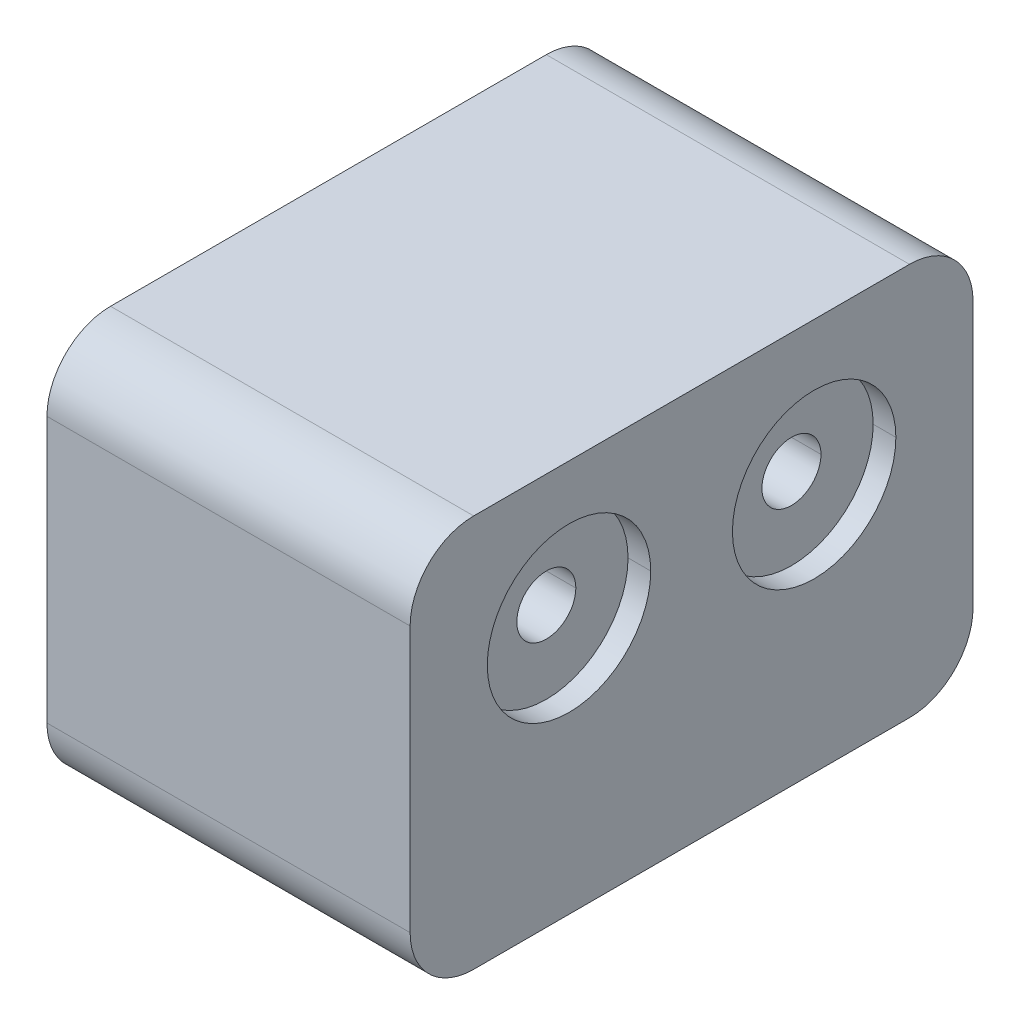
ISO-10303-21;
HEADER;
FILE_DESCRIPTION(('STEP AP214'),'2;1');
FILE_NAME('part.step','',(''),(''),'','','');
FILE_SCHEMA(('AUTOMOTIVE_DESIGN { 1 0 10303 214 1 1 1 1 }'));
ENDSEC;
DATA;
#1=APPLICATION_CONTEXT('core data for automotive mechanical design processes');
#2=APPLICATION_PROTOCOL_DEFINITION('international standard','automotive_design',2000,#1);
#3=PRODUCT_CONTEXT('',#1,'mechanical');
#4=PRODUCT('Part','Part','',(#3));
#5=PRODUCT_RELATED_PRODUCT_CATEGORY('part','',(#4));
#6=PRODUCT_DEFINITION_FORMATION('','',#4);
#7=PRODUCT_DEFINITION_CONTEXT('part definition',#1,'design');
#8=PRODUCT_DEFINITION('design','',#6,#7);
#9=PRODUCT_DEFINITION_SHAPE('','',#8);
#10=(LENGTH_UNIT() NAMED_UNIT(*) SI_UNIT(.MILLI.,.METRE.));
#11=(NAMED_UNIT(*) PLANE_ANGLE_UNIT() SI_UNIT($,.RADIAN.));
#12=(NAMED_UNIT(*) SI_UNIT($,.STERADIAN.) SOLID_ANGLE_UNIT());
#13=UNCERTAINTY_MEASURE_WITH_UNIT(LENGTH_MEASURE(1.E-05),#10,'distance_accuracy_value','');
#14=(GEOMETRIC_REPRESENTATION_CONTEXT(3) GLOBAL_UNCERTAINTY_ASSIGNED_CONTEXT((#13)) GLOBAL_UNIT_ASSIGNED_CONTEXT((#10,
#11,#12)) REPRESENTATION_CONTEXT('',''));
#15=CARTESIAN_POINT('',(0.,0.,0.));
#16=DIRECTION('',(0.,0.,1.));
#17=DIRECTION('',(1.,0.,0.));
#18=AXIS2_PLACEMENT_3D('',#15,#16,#17);
#19=CARTESIAN_POINT('',(8.,2.6,6.2));
#20=DIRECTION('',(0.,0.,-1.));
#21=DIRECTION('',(-1.,0.,0.));
#22=AXIS2_PLACEMENT_3D('',#19,#20,#21);
#23=PLANE('',#22);
#24=DIRECTION('',(0.,-1.,0.));
#25=VECTOR('',#24,1.);
#26=CARTESIAN_POINT('',(0.,2.6,6.2));
#27=LINE('',#26,#25);
#28=CARTESIAN_POINT('',(0.,2.6,6.2));
#29=VERTEX_POINT('',#28);
#30=CARTESIAN_POINT('',(0.,-3.25,6.2));
#31=VERTEX_POINT('',#30);
#32=EDGE_CURVE('E11',#29,#31,#27,.T.);
#33=ORIENTED_EDGE('',*,*,#32,.T.);
#34=DIRECTION('',(-1.,0.,0.));
#35=VECTOR('',#34,1.);
#36=CARTESIAN_POINT('',(8.,-3.25,6.2));
#37=LINE('',#36,#35);
#38=CARTESIAN_POINT('',(8.,-3.25,6.2));
#39=VERTEX_POINT('',#38);
#40=EDGE_CURVE('E25',#39,#31,#37,.T.);
#41=ORIENTED_EDGE('',*,*,#40,.F.);
#42=DIRECTION('',(0.,-1.,0.));
#43=VECTOR('',#42,1.);
#44=CARTESIAN_POINT('',(8.,2.6,6.2));
#45=LINE('',#44,#43);
#46=CARTESIAN_POINT('',(8.,2.6,6.2));
#47=VERTEX_POINT('',#46);
#48=EDGE_CURVE('E425',#47,#39,#45,.T.);
#49=ORIENTED_EDGE('',*,*,#48,.F.);
#50=DIRECTION('',(-1.,0.,0.));
#51=VECTOR('',#50,1.);
#52=CARTESIAN_POINT('',(8.,2.6,6.2));
#53=LINE('',#52,#51);
#54=EDGE_CURVE('E421',#47,#29,#53,.T.);
#55=ORIENTED_EDGE('',*,*,#54,.T.);
#56=EDGE_LOOP('',(#33,#41,#49,#55));
#57=FACE_BOUND('',#56,.T.);
#58=ADVANCED_FACE('F17',(#57),#23,.F.);
#59=CARTESIAN_POINT('',(8.,2.60000000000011,4.80000000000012));
#60=DIRECTION('',(-1.,0.,0.));
#61=DIRECTION('',(0.,-0.707106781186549,-0.707106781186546));
#62=AXIS2_PLACEMENT_3D('',#59,#60,#61);
#63=CYLINDRICAL_SURFACE('',#62,1.39999999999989);
#64=CARTESIAN_POINT('',(0.,2.60000000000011,4.80000000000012));
#65=DIRECTION('',(1.,0.,0.));
#66=DIRECTION('',(0.,0.,-1.));
#67=AXIS2_PLACEMENT_3D('',#64,#65,#66);
#68=CIRCLE('',#67,1.39999999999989);
#69=CARTESIAN_POINT('',(0.,4.,4.8));
#70=VERTEX_POINT('',#69);
#71=EDGE_CURVE('E416',#70,#29,#68,.T.);
#72=ORIENTED_EDGE('',*,*,#71,.T.);
#73=ORIENTED_EDGE('',*,*,#54,.F.);
#74=CARTESIAN_POINT('',(8.,2.60000000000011,4.80000000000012));
#75=DIRECTION('',(1.,0.,0.));
#76=DIRECTION('',(0.,0.,-1.));
#77=AXIS2_PLACEMENT_3D('',#74,#75,#76);
#78=CIRCLE('',#77,1.39999999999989);
#79=CARTESIAN_POINT('',(8.,4.,4.8));
#80=VERTEX_POINT('',#79);
#81=EDGE_CURVE('E411',#80,#47,#78,.T.);
#82=ORIENTED_EDGE('',*,*,#81,.F.);
#83=DIRECTION('',(-1.,0.,0.));
#84=VECTOR('',#83,1.);
#85=CARTESIAN_POINT('',(8.,4.,4.8));
#86=LINE('',#85,#84);
#87=EDGE_CURVE('E407',#80,#70,#86,.T.);
#88=ORIENTED_EDGE('',*,*,#87,.T.);
#89=EDGE_LOOP('',(#72,#73,#82,#88));
#90=FACE_BOUND('',#89,.T.);
#91=ADVANCED_FACE('F443',(#90),#63,.T.);
#92=CARTESIAN_POINT('',(8.,4.,-4.8));
#93=DIRECTION('',(0.,-1.,0.));
#94=DIRECTION('',(0.,0.,-1.));
#95=AXIS2_PLACEMENT_3D('',#92,#93,#94);
#96=PLANE('',#95);
#97=DIRECTION('',(0.,0.,1.));
#98=VECTOR('',#97,1.);
#99=CARTESIAN_POINT('',(0.,4.,-4.8));
#100=LINE('',#99,#98);
#101=CARTESIAN_POINT('',(0.,4.,-4.8));
#102=VERTEX_POINT('',#101);
#103=EDGE_CURVE('E402',#102,#70,#100,.T.);
#104=ORIENTED_EDGE('',*,*,#103,.T.);
#105=ORIENTED_EDGE('',*,*,#87,.F.);
#106=DIRECTION('',(0.,0.,1.));
#107=VECTOR('',#106,1.);
#108=CARTESIAN_POINT('',(8.,4.,-4.8));
#109=LINE('',#108,#107);
#110=CARTESIAN_POINT('',(8.,4.,-4.8));
#111=VERTEX_POINT('',#110);
#112=EDGE_CURVE('E397',#111,#80,#109,.T.);
#113=ORIENTED_EDGE('',*,*,#112,.F.);
#114=DIRECTION('',(-1.,0.,0.));
#115=VECTOR('',#114,1.);
#116=CARTESIAN_POINT('',(8.,4.,-4.8));
#117=LINE('',#116,#115);
#118=EDGE_CURVE('E393',#111,#102,#117,.T.);
#119=ORIENTED_EDGE('',*,*,#118,.T.);
#120=EDGE_LOOP('',(#104,#105,#113,#119));
#121=FACE_BOUND('',#120,.T.);
#122=ADVANCED_FACE('F464',(#121),#96,.F.);
#123=CARTESIAN_POINT('',(8.,2.60000000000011,-4.80000000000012));
#124=DIRECTION('',(-1.,0.,0.));
#125=DIRECTION('',(0.,-0.707106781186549,0.707106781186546));
#126=AXIS2_PLACEMENT_3D('',#123,#124,#125);
#127=CYLINDRICAL_SURFACE('',#126,1.39999999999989);
#128=CARTESIAN_POINT('',(0.,2.60000000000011,-4.80000000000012));
#129=DIRECTION('',(1.,0.,0.));
#130=DIRECTION('',(0.,0.,-1.));
#131=AXIS2_PLACEMENT_3D('',#128,#129,#130);
#132=CIRCLE('',#131,1.39999999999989);
#133=CARTESIAN_POINT('',(0.,2.6,-6.2));
#134=VERTEX_POINT('',#133);
#135=EDGE_CURVE('E388',#134,#102,#132,.T.);
#136=ORIENTED_EDGE('',*,*,#135,.T.);
#137=ORIENTED_EDGE('',*,*,#118,.F.);
#138=CARTESIAN_POINT('',(8.,2.60000000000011,-4.80000000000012));
#139=DIRECTION('',(1.,0.,0.));
#140=DIRECTION('',(0.,0.,-1.));
#141=AXIS2_PLACEMENT_3D('',#138,#139,#140);
#142=CIRCLE('',#141,1.39999999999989);
#143=CARTESIAN_POINT('',(8.,2.6,-6.2));
#144=VERTEX_POINT('',#143);
#145=EDGE_CURVE('E383',#144,#111,#142,.T.);
#146=ORIENTED_EDGE('',*,*,#145,.F.);
#147=DIRECTION('',(-1.,0.,0.));
#148=VECTOR('',#147,1.);
#149=CARTESIAN_POINT('',(8.,2.6,-6.2));
#150=LINE('',#149,#148);
#151=EDGE_CURVE('E379',#144,#134,#150,.T.);
#152=ORIENTED_EDGE('',*,*,#151,.T.);
#153=EDGE_LOOP('',(#136,#137,#146,#152));
#154=FACE_BOUND('',#153,.T.);
#155=ADVANCED_FACE('F461',(#154),#127,.T.);
#156=CARTESIAN_POINT('',(8.,-3.25,-6.2));
#157=DIRECTION('',(0.,0.,1.));
#158=DIRECTION('',(1.,0.,0.));
#159=AXIS2_PLACEMENT_3D('',#156,#157,#158);
#160=PLANE('',#159);
#161=DIRECTION('',(0.,1.,0.));
#162=VECTOR('',#161,1.);
#163=CARTESIAN_POINT('',(0.,-3.25,-6.2));
#164=LINE('',#163,#162);
#165=CARTESIAN_POINT('',(0.,-3.25,-6.2));
#166=VERTEX_POINT('',#165);
#167=EDGE_CURVE('E374',#166,#134,#164,.T.);
#168=ORIENTED_EDGE('',*,*,#167,.T.);
#169=ORIENTED_EDGE('',*,*,#151,.F.);
#170=DIRECTION('',(0.,1.,0.));
#171=VECTOR('',#170,1.);
#172=CARTESIAN_POINT('',(8.,-3.25,-6.2));
#173=LINE('',#172,#171);
#174=CARTESIAN_POINT('',(8.,-3.25,-6.2));
#175=VERTEX_POINT('',#174);
#176=EDGE_CURVE('E369',#175,#144,#173,.T.);
#177=ORIENTED_EDGE('',*,*,#176,.F.);
#178=DIRECTION('',(-1.,0.,0.));
#179=VECTOR('',#178,1.);
#180=CARTESIAN_POINT('',(8.,-3.25,-6.2));
#181=LINE('',#180,#179);
#182=EDGE_CURVE('E365',#175,#166,#181,.T.);
#183=ORIENTED_EDGE('',*,*,#182,.T.);
#184=EDGE_LOOP('',(#168,#169,#177,#183));
#185=FACE_BOUND('',#184,.T.);
#186=ADVANCED_FACE('F457',(#185),#160,.F.);
#187=CARTESIAN_POINT('',(8.,-3.25000000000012,-4.80000000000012));
#188=DIRECTION('',(-1.,0.,0.));
#189=DIRECTION('',(0.,0.707106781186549,0.707106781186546));
#190=AXIS2_PLACEMENT_3D('',#187,#188,#189);
#191=CYLINDRICAL_SURFACE('',#190,1.39999999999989);
#192=CARTESIAN_POINT('',(0.,-3.25000000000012,-4.80000000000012));
#193=DIRECTION('',(1.,0.,0.));
#194=DIRECTION('',(0.,0.,-1.));
#195=AXIS2_PLACEMENT_3D('',#192,#193,#194);
#196=CIRCLE('',#195,1.39999999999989);
#197=CARTESIAN_POINT('',(0.,-4.65,-4.8));
#198=VERTEX_POINT('',#197);
#199=EDGE_CURVE('E360',#198,#166,#196,.T.);
#200=ORIENTED_EDGE('',*,*,#199,.T.);
#201=ORIENTED_EDGE('',*,*,#182,.F.);
#202=CARTESIAN_POINT('',(8.,-3.25000000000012,-4.80000000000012));
#203=DIRECTION('',(1.,0.,0.));
#204=DIRECTION('',(0.,0.,-1.));
#205=AXIS2_PLACEMENT_3D('',#202,#203,#204);
#206=CIRCLE('',#205,1.39999999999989);
#207=CARTESIAN_POINT('',(8.,-4.65,-4.8));
#208=VERTEX_POINT('',#207);
#209=EDGE_CURVE('E355',#208,#175,#206,.T.);
#210=ORIENTED_EDGE('',*,*,#209,.F.);
#211=DIRECTION('',(-1.,0.,0.));
#212=VECTOR('',#211,1.);
#213=CARTESIAN_POINT('',(8.,-4.65,-4.8));
#214=LINE('',#213,#212);
#215=EDGE_CURVE('E351',#208,#198,#214,.T.);
#216=ORIENTED_EDGE('',*,*,#215,.T.);
#217=EDGE_LOOP('',(#200,#201,#210,#216));
#218=FACE_BOUND('',#217,.T.);
#219=ADVANCED_FACE('F455',(#218),#191,.T.);
#220=CARTESIAN_POINT('',(8.,-4.65,4.8));
#221=DIRECTION('',(0.,1.,0.));
#222=DIRECTION('',(0.,0.,1.));
#223=AXIS2_PLACEMENT_3D('',#220,#221,#222);
#224=PLANE('',#223);
#225=DIRECTION('',(0.,0.,-1.));
#226=VECTOR('',#225,1.);
#227=CARTESIAN_POINT('',(0.,-4.65,4.8));
#228=LINE('',#227,#226);
#229=CARTESIAN_POINT('',(0.,-4.65,4.8));
#230=VERTEX_POINT('',#229);
#231=EDGE_CURVE('E346',#230,#198,#228,.T.);
#232=ORIENTED_EDGE('',*,*,#231,.T.);
#233=ORIENTED_EDGE('',*,*,#215,.F.);
#234=DIRECTION('',(0.,0.,-1.));
#235=VECTOR('',#234,1.);
#236=CARTESIAN_POINT('',(8.,-4.65,4.8));
#237=LINE('',#236,#235);
#238=CARTESIAN_POINT('',(8.,-4.65,4.8));
#239=VERTEX_POINT('',#238);
#240=EDGE_CURVE('E341',#239,#208,#237,.T.);
#241=ORIENTED_EDGE('',*,*,#240,.F.);
#242=DIRECTION('',(-1.,0.,0.));
#243=VECTOR('',#242,1.);
#244=CARTESIAN_POINT('',(8.,-4.65,4.8));
#245=LINE('',#244,#243);
#246=EDGE_CURVE('E337',#239,#230,#245,.T.);
#247=ORIENTED_EDGE('',*,*,#246,.T.);
#248=EDGE_LOOP('',(#232,#233,#241,#247));
#249=FACE_BOUND('',#248,.T.);
#250=ADVANCED_FACE('F452',(#249),#224,.F.);
#251=CARTESIAN_POINT('',(8.,-3.25000000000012,4.80000000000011));
#252=DIRECTION('',(-1.,0.,0.));
#253=DIRECTION('',(0.,0.707106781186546,-0.707106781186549));
#254=AXIS2_PLACEMENT_3D('',#251,#252,#253);
#255=CYLINDRICAL_SURFACE('',#254,1.39999999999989);
#256=CARTESIAN_POINT('',(0.,-3.25000000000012,4.80000000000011));
#257=DIRECTION('',(1.,0.,0.));
#258=DIRECTION('',(0.,0.,-1.));
#259=AXIS2_PLACEMENT_3D('',#256,#257,#258);
#260=CIRCLE('',#259,1.39999999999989);
#261=EDGE_CURVE('E332',#31,#230,#260,.T.);
#262=ORIENTED_EDGE('',*,*,#261,.T.);
#263=ORIENTED_EDGE('',*,*,#246,.F.);
#264=CARTESIAN_POINT('',(8.,-3.25000000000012,4.80000000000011));
#265=DIRECTION('',(1.,0.,0.));
#266=DIRECTION('',(0.,0.,-1.));
#267=AXIS2_PLACEMENT_3D('',#264,#265,#266);
#268=CIRCLE('',#267,1.39999999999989);
#269=EDGE_CURVE('E327',#39,#239,#268,.T.);
#270=ORIENTED_EDGE('',*,*,#269,.F.);
#271=ORIENTED_EDGE('',*,*,#40,.T.);
#272=EDGE_LOOP('',(#262,#263,#270,#271));
#273=FACE_BOUND('',#272,.T.);
#274=ADVANCED_FACE('F435',(#273),#255,.T.);
#275=CARTESIAN_POINT('',(8.,-3.25000000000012,4.80000000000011));
#276=DIRECTION('',(1.,0.,0.));
#277=DIRECTION('',(0.,0.,-1.));
#278=AXIS2_PLACEMENT_3D('',#275,#276,#277);
#279=PLANE('',#278);
#280=CARTESIAN_POINT('',(8.,0.85,-2.7));
#281=DIRECTION('',(1.,0.,0.));
#282=DIRECTION('',(0.,0.,-1.));
#283=AXIS2_PLACEMENT_3D('',#280,#281,#282);
#284=CIRCLE('',#283,1.8);
#285=CARTESIAN_POINT('',(8.,0.85,-0.9));
#286=VERTEX_POINT('',#285);
#287=CARTESIAN_POINT('',(8.,0.85,-4.5));
#288=VERTEX_POINT('',#287);
#289=EDGE_CURVE('E169',#286,#288,#284,.T.);
#290=ORIENTED_EDGE('',*,*,#289,.F.);
#291=CARTESIAN_POINT('',(8.,0.85,-2.7));
#292=DIRECTION('',(1.,0.,0.));
#293=DIRECTION('',(0.,0.,-1.));
#294=AXIS2_PLACEMENT_3D('',#291,#292,#293);
#295=CIRCLE('',#294,1.8);
#296=EDGE_CURVE('E320',#288,#286,#295,.T.);
#297=ORIENTED_EDGE('',*,*,#296,.F.);
#298=EDGE_LOOP('',(#290,#297));
#299=FACE_BOUND('',#298,.T.);
#300=CARTESIAN_POINT('',(8.,1.,2.7));
#301=DIRECTION('',(1.,0.,0.));
#302=DIRECTION('',(0.,0.,-1.));
#303=AXIS2_PLACEMENT_3D('',#300,#301,#302);
#304=CIRCLE('',#303,1.8);
#305=CARTESIAN_POINT('',(8.,1.,4.5));
#306=VERTEX_POINT('',#305);
#307=CARTESIAN_POINT('',(8.,1.,0.9));
#308=VERTEX_POINT('',#307);
#309=EDGE_CURVE('E315',#306,#308,#304,.T.);
#310=ORIENTED_EDGE('',*,*,#309,.F.);
#311=CARTESIAN_POINT('',(8.,1.,2.7));
#312=DIRECTION('',(1.,0.,0.));
#313=DIRECTION('',(0.,0.,-1.));
#314=AXIS2_PLACEMENT_3D('',#311,#312,#313);
#315=CIRCLE('',#314,1.8);
#316=EDGE_CURVE('E310',#308,#306,#315,.T.);
#317=ORIENTED_EDGE('',*,*,#316,.F.);
#318=EDGE_LOOP('',(#310,#317));
#319=FACE_BOUND('',#318,.T.);
#320=ORIENTED_EDGE('',*,*,#48,.T.);
#321=ORIENTED_EDGE('',*,*,#269,.T.);
#322=ORIENTED_EDGE('',*,*,#240,.T.);
#323=ORIENTED_EDGE('',*,*,#209,.T.);
#324=ORIENTED_EDGE('',*,*,#176,.T.);
#325=ORIENTED_EDGE('',*,*,#145,.T.);
#326=ORIENTED_EDGE('',*,*,#112,.T.);
#327=ORIENTED_EDGE('',*,*,#81,.T.);
#328=EDGE_LOOP('',(#320,#321,#322,#323,#324,#325,#326,#327));
#329=FACE_BOUND('',#328,.T.);
#330=ADVANCED_FACE('F439',(#299,#319,#329),#279,.T.);
#331=CARTESIAN_POINT('',(8.,1.,2.7));
#332=DIRECTION('',(1.,0.,0.));
#333=DIRECTION('',(0.,-1.,0.));
#334=AXIS2_PLACEMENT_3D('',#331,#332,#333);
#335=CYLINDRICAL_SURFACE('',#334,1.8);
#336=DIRECTION('',(1.,0.,0.));
#337=VECTOR('',#336,1.);
#338=CARTESIAN_POINT('',(7.5,1.,4.5));
#339=LINE('',#338,#337);
#340=CARTESIAN_POINT('',(7.5,1.,4.5));
#341=VERTEX_POINT('',#340);
#342=EDGE_CURVE('E305',#341,#306,#339,.T.);
#343=ORIENTED_EDGE('',*,*,#342,.F.);
#344=CARTESIAN_POINT('',(7.5,1.,2.7));
#345=DIRECTION('',(1.,0.,0.));
#346=DIRECTION('',(0.,0.,-1.));
#347=AXIS2_PLACEMENT_3D('',#344,#345,#346);
#348=CIRCLE('',#347,1.8);
#349=CARTESIAN_POINT('',(7.5,1.,0.9));
#350=VERTEX_POINT('',#349);
#351=EDGE_CURVE('E300',#350,#341,#348,.T.);
#352=ORIENTED_EDGE('',*,*,#351,.F.);
#353=DIRECTION('',(1.,0.,0.));
#354=VECTOR('',#353,1.);
#355=CARTESIAN_POINT('',(7.5,1.,0.9));
#356=LINE('',#355,#354);
#357=EDGE_CURVE('E295',#350,#308,#356,.T.);
#358=ORIENTED_EDGE('',*,*,#357,.T.);
#359=ORIENTED_EDGE('',*,*,#316,.T.);
#360=EDGE_LOOP('',(#343,#352,#358,#359));
#361=FACE_BOUND('',#360,.T.);
#362=ADVANCED_FACE('F535',(#361),#335,.F.);
#363=CARTESIAN_POINT('',(8.,1.,2.7));
#364=DIRECTION('',(1.,0.,0.));
#365=DIRECTION('',(0.,1.,0.));
#366=AXIS2_PLACEMENT_3D('',#363,#364,#365);
#367=CYLINDRICAL_SURFACE('',#366,1.8);
#368=ORIENTED_EDGE('',*,*,#342,.T.);
#369=ORIENTED_EDGE('',*,*,#309,.T.);
#370=ORIENTED_EDGE('',*,*,#357,.F.);
#371=CARTESIAN_POINT('',(7.5,1.,2.7));
#372=DIRECTION('',(1.,0.,0.));
#373=DIRECTION('',(0.,0.,-1.));
#374=AXIS2_PLACEMENT_3D('',#371,#372,#373);
#375=CIRCLE('',#374,1.8);
#376=EDGE_CURVE('E290',#341,#350,#375,.T.);
#377=ORIENTED_EDGE('',*,*,#376,.F.);
#378=EDGE_LOOP('',(#368,#369,#370,#377));
#379=FACE_BOUND('',#378,.T.);
#380=ADVANCED_FACE('F545',(#379),#367,.F.);
#381=CARTESIAN_POINT('',(7.5,1.65,2.7));
#382=DIRECTION('',(1.,0.,0.));
#383=DIRECTION('',(0.,0.,-1.));
#384=AXIS2_PLACEMENT_3D('',#381,#382,#383);
#385=PLANE('',#384);
#386=ORIENTED_EDGE('',*,*,#351,.T.);
#387=ORIENTED_EDGE('',*,*,#376,.T.);
#388=EDGE_LOOP('',(#386,#387));
#389=FACE_BOUND('',#388,.T.);
#390=CARTESIAN_POINT('',(7.5,1.,2.7));
#391=DIRECTION('',(1.,0.,0.));
#392=DIRECTION('',(0.,0.,-1.));
#393=AXIS2_PLACEMENT_3D('',#390,#391,#392);
#394=CIRCLE('',#393,0.65);
#395=CARTESIAN_POINT('',(7.5,1.,3.35));
#396=VERTEX_POINT('',#395);
#397=CARTESIAN_POINT('',(7.5,1.,2.05));
#398=VERTEX_POINT('',#397);
#399=EDGE_CURVE('E285',#396,#398,#394,.T.);
#400=ORIENTED_EDGE('',*,*,#399,.F.);
#401=CARTESIAN_POINT('',(7.5,1.,2.7));
#402=DIRECTION('',(1.,0.,0.));
#403=DIRECTION('',(0.,0.,-1.));
#404=AXIS2_PLACEMENT_3D('',#401,#402,#403);
#405=CIRCLE('',#404,0.65);
#406=EDGE_CURVE('E280',#398,#396,#405,.T.);
#407=ORIENTED_EDGE('',*,*,#406,.F.);
#408=EDGE_LOOP('',(#400,#407));
#409=FACE_BOUND('',#408,.T.);
#410=ADVANCED_FACE('F555',(#389,#409),#385,.T.);
#411=CARTESIAN_POINT('',(8.,1.,2.7));
#412=DIRECTION('',(1.,0.,0.));
#413=DIRECTION('',(0.,-1.,0.));
#414=AXIS2_PLACEMENT_3D('',#411,#412,#413);
#415=CYLINDRICAL_SURFACE('',#414,0.65);
#416=DIRECTION('',(1.,0.,0.));
#417=VECTOR('',#416,1.);
#418=CARTESIAN_POINT('',(0.5,1.,3.35));
#419=LINE('',#418,#417);
#420=CARTESIAN_POINT('',(0.5,1.,3.35));
#421=VERTEX_POINT('',#420);
#422=EDGE_CURVE('E275',#421,#396,#419,.T.);
#423=ORIENTED_EDGE('',*,*,#422,.F.);
#424=CARTESIAN_POINT('',(0.5,1.,2.7));
#425=DIRECTION('',(1.,0.,0.));
#426=DIRECTION('',(0.,0.,-1.));
#427=AXIS2_PLACEMENT_3D('',#424,#425,#426);
#428=CIRCLE('',#427,0.65);
#429=CARTESIAN_POINT('',(0.5,1.,2.05));
#430=VERTEX_POINT('',#429);
#431=EDGE_CURVE('E270',#430,#421,#428,.T.);
#432=ORIENTED_EDGE('',*,*,#431,.F.);
#433=DIRECTION('',(1.,0.,0.));
#434=VECTOR('',#433,1.);
#435=CARTESIAN_POINT('',(0.5,1.,2.05));
#436=LINE('',#435,#434);
#437=EDGE_CURVE('E265',#430,#398,#436,.T.);
#438=ORIENTED_EDGE('',*,*,#437,.T.);
#439=ORIENTED_EDGE('',*,*,#406,.T.);
#440=EDGE_LOOP('',(#423,#432,#438,#439));
#441=FACE_BOUND('',#440,.T.);
#442=ADVANCED_FACE('F565',(#441),#415,.F.);
#443=CARTESIAN_POINT('',(8.,1.,2.7));
#444=DIRECTION('',(1.,0.,0.));
#445=DIRECTION('',(0.,1.,0.));
#446=AXIS2_PLACEMENT_3D('',#443,#444,#445);
#447=CYLINDRICAL_SURFACE('',#446,0.65);
#448=ORIENTED_EDGE('',*,*,#422,.T.);
#449=ORIENTED_EDGE('',*,*,#399,.T.);
#450=ORIENTED_EDGE('',*,*,#437,.F.);
#451=CARTESIAN_POINT('',(0.5,1.,2.7));
#452=DIRECTION('',(1.,0.,0.));
#453=DIRECTION('',(0.,0.,-1.));
#454=AXIS2_PLACEMENT_3D('',#451,#452,#453);
#455=CIRCLE('',#454,0.65);
#456=EDGE_CURVE('E260',#421,#430,#455,.T.);
#457=ORIENTED_EDGE('',*,*,#456,.F.);
#458=EDGE_LOOP('',(#448,#449,#450,#457));
#459=FACE_BOUND('',#458,.T.);
#460=ADVANCED_FACE('F575',(#459),#447,.F.);
#461=CARTESIAN_POINT('',(0.5,2.8,2.7));
#462=DIRECTION('',(-1.,0.,0.));
#463=DIRECTION('',(0.,0.,1.));
#464=AXIS2_PLACEMENT_3D('',#461,#462,#463);
#465=PLANE('',#464);
#466=ORIENTED_EDGE('',*,*,#431,.T.);
#467=ORIENTED_EDGE('',*,*,#456,.T.);
#468=EDGE_LOOP('',(#466,#467));
#469=FACE_BOUND('',#468,.T.);
#470=CARTESIAN_POINT('',(0.5,1.,2.7));
#471=DIRECTION('',(1.,0.,0.));
#472=DIRECTION('',(0.,0.,-1.));
#473=AXIS2_PLACEMENT_3D('',#470,#471,#472);
#474=CIRCLE('',#473,1.8);
#475=CARTESIAN_POINT('',(0.5,1.,4.5));
#476=VERTEX_POINT('',#475);
#477=CARTESIAN_POINT('',(0.5,1.,0.9));
#478=VERTEX_POINT('',#477);
#479=EDGE_CURVE('E255',#476,#478,#474,.T.);
#480=ORIENTED_EDGE('',*,*,#479,.F.);
#481=CARTESIAN_POINT('',(0.5,1.,2.7));
#482=DIRECTION('',(1.,0.,0.));
#483=DIRECTION('',(0.,0.,-1.));
#484=AXIS2_PLACEMENT_3D('',#481,#482,#483);
#485=CIRCLE('',#484,1.8);
#486=EDGE_CURVE('E250',#478,#476,#485,.T.);
#487=ORIENTED_EDGE('',*,*,#486,.F.);
#488=EDGE_LOOP('',(#480,#487));
#489=FACE_BOUND('',#488,.T.);
#490=ADVANCED_FACE('F585',(#469,#489),#465,.T.);
#491=CARTESIAN_POINT('',(8.,1.,2.7));
#492=DIRECTION('',(1.,0.,0.));
#493=DIRECTION('',(0.,-1.,0.));
#494=AXIS2_PLACEMENT_3D('',#491,#492,#493);
#495=CYLINDRICAL_SURFACE('',#494,1.8);
#496=DIRECTION('',(1.,0.,0.));
#497=VECTOR('',#496,1.);
#498=CARTESIAN_POINT('',(0.,1.,4.5));
#499=LINE('',#498,#497);
#500=CARTESIAN_POINT('',(0.,1.,4.5));
#501=VERTEX_POINT('',#500);
#502=EDGE_CURVE('E245',#501,#476,#499,.T.);
#503=ORIENTED_EDGE('',*,*,#502,.F.);
#504=CARTESIAN_POINT('',(0.,1.,2.7));
#505=DIRECTION('',(1.,0.,0.));
#506=DIRECTION('',(0.,0.,-1.));
#507=AXIS2_PLACEMENT_3D('',#504,#505,#506);
#508=CIRCLE('',#507,1.8);
#509=CARTESIAN_POINT('',(0.,1.,0.9));
#510=VERTEX_POINT('',#509);
#511=EDGE_CURVE('E240',#510,#501,#508,.T.);
#512=ORIENTED_EDGE('',*,*,#511,.F.);
#513=DIRECTION('',(1.,0.,0.));
#514=VECTOR('',#513,1.);
#515=CARTESIAN_POINT('',(0.,1.,0.9));
#516=LINE('',#515,#514);
#517=EDGE_CURVE('E235',#510,#478,#516,.T.);
#518=ORIENTED_EDGE('',*,*,#517,.T.);
#519=ORIENTED_EDGE('',*,*,#486,.T.);
#520=EDGE_LOOP('',(#503,#512,#518,#519));
#521=FACE_BOUND('',#520,.T.);
#522=ADVANCED_FACE('F595',(#521),#495,.F.);
#523=CARTESIAN_POINT('',(8.,1.,2.7));
#524=DIRECTION('',(1.,0.,0.));
#525=DIRECTION('',(0.,1.,0.));
#526=AXIS2_PLACEMENT_3D('',#523,#524,#525);
#527=CYLINDRICAL_SURFACE('',#526,1.8);
#528=ORIENTED_EDGE('',*,*,#502,.T.);
#529=ORIENTED_EDGE('',*,*,#479,.T.);
#530=ORIENTED_EDGE('',*,*,#517,.F.);
#531=CARTESIAN_POINT('',(0.,1.,2.7));
#532=DIRECTION('',(1.,0.,0.));
#533=DIRECTION('',(0.,0.,-1.));
#534=AXIS2_PLACEMENT_3D('',#531,#532,#533);
#535=CIRCLE('',#534,1.8);
#536=EDGE_CURVE('E230',#501,#510,#535,.T.);
#537=ORIENTED_EDGE('',*,*,#536,.F.);
#538=EDGE_LOOP('',(#528,#529,#530,#537));
#539=FACE_BOUND('',#538,.T.);
#540=ADVANCED_FACE('F605',(#539),#527,.F.);
#541=CARTESIAN_POINT('',(0.,-3.25000000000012,4.80000000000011));
#542=DIRECTION('',(1.,0.,0.));
#543=DIRECTION('',(0.,0.,-1.));
#544=AXIS2_PLACEMENT_3D('',#541,#542,#543);
#545=PLANE('',#544);
#546=CARTESIAN_POINT('',(0.,0.85,-2.7));
#547=DIRECTION('',(1.,0.,0.));
#548=DIRECTION('',(0.,0.,-1.));
#549=AXIS2_PLACEMENT_3D('',#546,#547,#548);
#550=CIRCLE('',#549,1.8);
#551=CARTESIAN_POINT('',(0.,0.85,-4.5));
#552=VERTEX_POINT('',#551);
#553=CARTESIAN_POINT('',(0.,0.85,-0.9));
#554=VERTEX_POINT('',#553);
#555=EDGE_CURVE('E226',#552,#554,#550,.T.);
#556=ORIENTED_EDGE('',*,*,#555,.T.);
#557=CARTESIAN_POINT('',(0.,0.85,-2.7));
#558=DIRECTION('',(1.,0.,0.));
#559=DIRECTION('',(0.,0.,-1.));
#560=AXIS2_PLACEMENT_3D('',#557,#558,#559);
#561=CIRCLE('',#560,1.8);
#562=EDGE_CURVE('E222',#554,#552,#561,.T.);
#563=ORIENTED_EDGE('',*,*,#562,.T.);
#564=EDGE_LOOP('',(#556,#563));
#565=FACE_BOUND('',#564,.T.);
#566=ORIENTED_EDGE('',*,*,#511,.T.);
#567=ORIENTED_EDGE('',*,*,#536,.T.);
#568=EDGE_LOOP('',(#566,#567));
#569=FACE_BOUND('',#568,.T.);
#570=ORIENTED_EDGE('',*,*,#32,.F.);
#571=ORIENTED_EDGE('',*,*,#71,.F.);
#572=ORIENTED_EDGE('',*,*,#103,.F.);
#573=ORIENTED_EDGE('',*,*,#135,.F.);
#574=ORIENTED_EDGE('',*,*,#167,.F.);
#575=ORIENTED_EDGE('',*,*,#199,.F.);
#576=ORIENTED_EDGE('',*,*,#231,.F.);
#577=ORIENTED_EDGE('',*,*,#261,.F.);
#578=EDGE_LOOP('',(#570,#571,#572,#573,#574,#575,#576,#577));
#579=FACE_BOUND('',#578,.T.);
#580=ADVANCED_FACE('F447',(#565,#569,#579),#545,.F.);
#581=CARTESIAN_POINT('',(8.,0.85,-2.7));
#582=DIRECTION('',(1.,0.,0.));
#583=DIRECTION('',(0.,1.,0.));
#584=AXIS2_PLACEMENT_3D('',#581,#582,#583);
#585=CYLINDRICAL_SURFACE('',#584,1.8);
#586=DIRECTION('',(1.,0.,0.));
#587=VECTOR('',#586,1.);
#588=CARTESIAN_POINT('',(0.,0.85,-0.9));
#589=LINE('',#588,#587);
#590=CARTESIAN_POINT('',(0.5,0.85,-0.9));
#591=VERTEX_POINT('',#590);
#592=EDGE_CURVE('E218',#554,#591,#589,.T.);
#593=ORIENTED_EDGE('',*,*,#592,.T.);
#594=CARTESIAN_POINT('',(0.5,0.85,-2.7));
#595=DIRECTION('',(1.,0.,0.));
#596=DIRECTION('',(0.,0.,-1.));
#597=AXIS2_PLACEMENT_3D('',#594,#595,#596);
#598=CIRCLE('',#597,1.8);
#599=CARTESIAN_POINT('',(0.5,0.85,-4.5));
#600=VERTEX_POINT('',#599);
#601=EDGE_CURVE('E214',#591,#600,#598,.T.);
#602=ORIENTED_EDGE('',*,*,#601,.T.);
#603=DIRECTION('',(1.,0.,0.));
#604=VECTOR('',#603,1.);
#605=CARTESIAN_POINT('',(0.,0.85,-4.5));
#606=LINE('',#605,#604);
#607=EDGE_CURVE('E209',#552,#600,#606,.T.);
#608=ORIENTED_EDGE('',*,*,#607,.F.);
#609=ORIENTED_EDGE('',*,*,#562,.F.);
#610=EDGE_LOOP('',(#593,#602,#608,#609));
#611=FACE_BOUND('',#610,.T.);
#612=ADVANCED_FACE('F624',(#611),#585,.F.);
#613=CARTESIAN_POINT('',(8.,0.85,-2.7));
#614=DIRECTION('',(1.,0.,0.));
#615=DIRECTION('',(0.,-1.,0.));
#616=AXIS2_PLACEMENT_3D('',#613,#614,#615);
#617=CYLINDRICAL_SURFACE('',#616,1.8);
#618=ORIENTED_EDGE('',*,*,#592,.F.);
#619=ORIENTED_EDGE('',*,*,#555,.F.);
#620=ORIENTED_EDGE('',*,*,#607,.T.);
#621=CARTESIAN_POINT('',(0.5,0.85,-2.7));
#622=DIRECTION('',(1.,0.,0.));
#623=DIRECTION('',(0.,0.,-1.));
#624=AXIS2_PLACEMENT_3D('',#621,#622,#623);
#625=CIRCLE('',#624,1.8);
#626=EDGE_CURVE('E204',#600,#591,#625,.T.);
#627=ORIENTED_EDGE('',*,*,#626,.T.);
#628=EDGE_LOOP('',(#618,#619,#620,#627));
#629=FACE_BOUND('',#628,.T.);
#630=ADVANCED_FACE('F634',(#629),#617,.F.);
#631=CARTESIAN_POINT('',(0.5,2.65,-2.7));
#632=DIRECTION('',(-1.,0.,0.));
#633=DIRECTION('',(0.,0.,1.));
#634=AXIS2_PLACEMENT_3D('',#631,#632,#633);
#635=PLANE('',#634);
#636=CARTESIAN_POINT('',(0.5,0.85,-2.7));
#637=DIRECTION('',(1.,0.,0.));
#638=DIRECTION('',(0.,0.,-1.));
#639=AXIS2_PLACEMENT_3D('',#636,#637,#638);
#640=CIRCLE('',#639,0.65);
#641=CARTESIAN_POINT('',(0.5,0.85,-3.35));
#642=VERTEX_POINT('',#641);
#643=CARTESIAN_POINT('',(0.5,0.85,-2.05));
#644=VERTEX_POINT('',#643);
#645=EDGE_CURVE('E200',#642,#644,#640,.T.);
#646=ORIENTED_EDGE('',*,*,#645,.T.);
#647=CARTESIAN_POINT('',(0.5,0.85,-2.7));
#648=DIRECTION('',(1.,0.,0.));
#649=DIRECTION('',(0.,0.,-1.));
#650=AXIS2_PLACEMENT_3D('',#647,#648,#649);
#651=CIRCLE('',#650,0.65);
#652=EDGE_CURVE('E196',#644,#642,#651,.T.);
#653=ORIENTED_EDGE('',*,*,#652,.T.);
#654=EDGE_LOOP('',(#646,#653));
#655=FACE_BOUND('',#654,.T.);
#656=ORIENTED_EDGE('',*,*,#601,.F.);
#657=ORIENTED_EDGE('',*,*,#626,.F.);
#658=EDGE_LOOP('',(#656,#657));
#659=FACE_BOUND('',#658,.T.);
#660=ADVANCED_FACE('F644',(#655,#659),#635,.T.);
#661=CARTESIAN_POINT('',(8.,0.85,-2.7));
#662=DIRECTION('',(1.,0.,0.));
#663=DIRECTION('',(0.,1.,0.));
#664=AXIS2_PLACEMENT_3D('',#661,#662,#663);
#665=CYLINDRICAL_SURFACE('',#664,0.65);
#666=DIRECTION('',(1.,0.,0.));
#667=VECTOR('',#666,1.);
#668=CARTESIAN_POINT('',(0.5,0.85,-2.05));
#669=LINE('',#668,#667);
#670=CARTESIAN_POINT('',(7.5,0.85,-2.05));
#671=VERTEX_POINT('',#670);
#672=EDGE_CURVE('E192',#644,#671,#669,.T.);
#673=ORIENTED_EDGE('',*,*,#672,.T.);
#674=CARTESIAN_POINT('',(7.5,0.85,-2.7));
#675=DIRECTION('',(1.,0.,0.));
#676=DIRECTION('',(0.,0.,-1.));
#677=AXIS2_PLACEMENT_3D('',#674,#675,#676);
#678=CIRCLE('',#677,0.65);
#679=CARTESIAN_POINT('',(7.5,0.85,-3.35));
#680=VERTEX_POINT('',#679);
#681=EDGE_CURVE('E188',#671,#680,#678,.T.);
#682=ORIENTED_EDGE('',*,*,#681,.T.);
#683=DIRECTION('',(1.,0.,0.));
#684=VECTOR('',#683,1.);
#685=CARTESIAN_POINT('',(0.5,0.85,-3.35));
#686=LINE('',#685,#684);
#687=EDGE_CURVE('E183',#642,#680,#686,.T.);
#688=ORIENTED_EDGE('',*,*,#687,.F.);
#689=ORIENTED_EDGE('',*,*,#652,.F.);
#690=EDGE_LOOP('',(#673,#682,#688,#689));
#691=FACE_BOUND('',#690,.T.);
#692=ADVANCED_FACE('F654',(#691),#665,.F.);
#693=CARTESIAN_POINT('',(8.,0.85,-2.7));
#694=DIRECTION('',(1.,0.,0.));
#695=DIRECTION('',(0.,-1.,0.));
#696=AXIS2_PLACEMENT_3D('',#693,#694,#695);
#697=CYLINDRICAL_SURFACE('',#696,0.65);
#698=ORIENTED_EDGE('',*,*,#672,.F.);
#699=ORIENTED_EDGE('',*,*,#645,.F.);
#700=ORIENTED_EDGE('',*,*,#687,.T.);
#701=CARTESIAN_POINT('',(7.5,0.85,-2.7));
#702=DIRECTION('',(1.,0.,0.));
#703=DIRECTION('',(0.,0.,-1.));
#704=AXIS2_PLACEMENT_3D('',#701,#702,#703);
#705=CIRCLE('',#704,0.65);
#706=EDGE_CURVE('E166',#680,#671,#705,.T.);
#707=ORIENTED_EDGE('',*,*,#706,.T.);
#708=EDGE_LOOP('',(#698,#699,#700,#707));
#709=FACE_BOUND('',#708,.T.);
#710=ADVANCED_FACE('F664',(#709),#697,.F.);
#711=CARTESIAN_POINT('',(7.5,1.5,-2.7));
#712=DIRECTION('',(1.,0.,0.));
#713=DIRECTION('',(0.,0.,-1.));
#714=AXIS2_PLACEMENT_3D('',#711,#712,#713);
#715=PLANE('',#714);
#716=CARTESIAN_POINT('',(7.5,0.85,-2.7));
#717=DIRECTION('',(1.,0.,0.));
#718=DIRECTION('',(0.,0.,-1.));
#719=AXIS2_PLACEMENT_3D('',#716,#717,#718);
#720=CIRCLE('',#719,1.8);
#721=CARTESIAN_POINT('',(7.5,0.85,-4.5));
#722=VERTEX_POINT('',#721);
#723=CARTESIAN_POINT('',(7.5,0.85,-0.9));
#724=VERTEX_POINT('',#723);
#725=EDGE_CURVE('E153',#722,#724,#720,.T.);
#726=ORIENTED_EDGE('',*,*,#725,.T.);
#727=CARTESIAN_POINT('',(7.5,0.85,-2.7));
#728=DIRECTION('',(1.,0.,0.));
#729=DIRECTION('',(0.,0.,-1.));
#730=AXIS2_PLACEMENT_3D('',#727,#728,#729);
#731=CIRCLE('',#730,1.8);
#732=EDGE_CURVE('E149',#724,#722,#731,.T.);
#733=ORIENTED_EDGE('',*,*,#732,.T.);
#734=EDGE_LOOP('',(#726,#733));
#735=FACE_BOUND('',#734,.T.);
#736=ORIENTED_EDGE('',*,*,#681,.F.);
#737=ORIENTED_EDGE('',*,*,#706,.F.);
#738=EDGE_LOOP('',(#736,#737));
#739=FACE_BOUND('',#738,.T.);
#740=ADVANCED_FACE('F151',(#735,#739),#715,.T.);
#741=CARTESIAN_POINT('',(8.,0.85,-2.7));
#742=DIRECTION('',(1.,0.,0.));
#743=DIRECTION('',(0.,1.,0.));
#744=AXIS2_PLACEMENT_3D('',#741,#742,#743);
#745=CYLINDRICAL_SURFACE('',#744,1.8);
#746=DIRECTION('',(1.,0.,0.));
#747=VECTOR('',#746,1.);
#748=CARTESIAN_POINT('',(7.5,0.85,-0.9));
#749=LINE('',#748,#747);
#750=EDGE_CURVE('E158',#724,#286,#749,.T.);
#751=ORIENTED_EDGE('',*,*,#750,.T.);
#752=ORIENTED_EDGE('',*,*,#289,.T.);
#753=DIRECTION('',(1.,0.,0.));
#754=VECTOR('',#753,1.);
#755=CARTESIAN_POINT('',(7.5,0.85,-4.5));
#756=LINE('',#755,#754);
#757=EDGE_CURVE('E164',#722,#288,#756,.T.);
#758=ORIENTED_EDGE('',*,*,#757,.F.);
#759=ORIENTED_EDGE('',*,*,#732,.F.);
#760=EDGE_LOOP('',(#751,#752,#758,#759));
#761=FACE_BOUND('',#760,.T.);
#762=ADVANCED_FACE('F168',(#761),#745,.F.);
#763=CARTESIAN_POINT('',(8.,0.85,-2.7));
#764=DIRECTION('',(1.,0.,0.));
#765=DIRECTION('',(0.,-1.,0.));
#766=AXIS2_PLACEMENT_3D('',#763,#764,#765);
#767=CYLINDRICAL_SURFACE('',#766,1.8);
#768=ORIENTED_EDGE('',*,*,#750,.F.);
#769=ORIENTED_EDGE('',*,*,#725,.F.);
#770=ORIENTED_EDGE('',*,*,#757,.T.);
#771=ORIENTED_EDGE('',*,*,#296,.T.);
#772=EDGE_LOOP('',(#768,#769,#770,#771));
#773=FACE_BOUND('',#772,.T.);
#774=ADVANCED_FACE('F162',(#773),#767,.F.);
#775=CLOSED_SHELL('',(#58,#91,#122,#155,#186,#219,#250,#274,#330,#362,#380,#410,#442,#460,#490,
#522,#540,#580,#612,#630,#660,#692,#710,#740,#762,#774));
#776=MANIFOLD_SOLID_BREP('B1',#775);
#777=ADVANCED_BREP_SHAPE_REPRESENTATION('',(#18,#776),#14);
#778=SHAPE_DEFINITION_REPRESENTATION(#9,#777);
ENDSEC;
END-ISO-10303-21;
